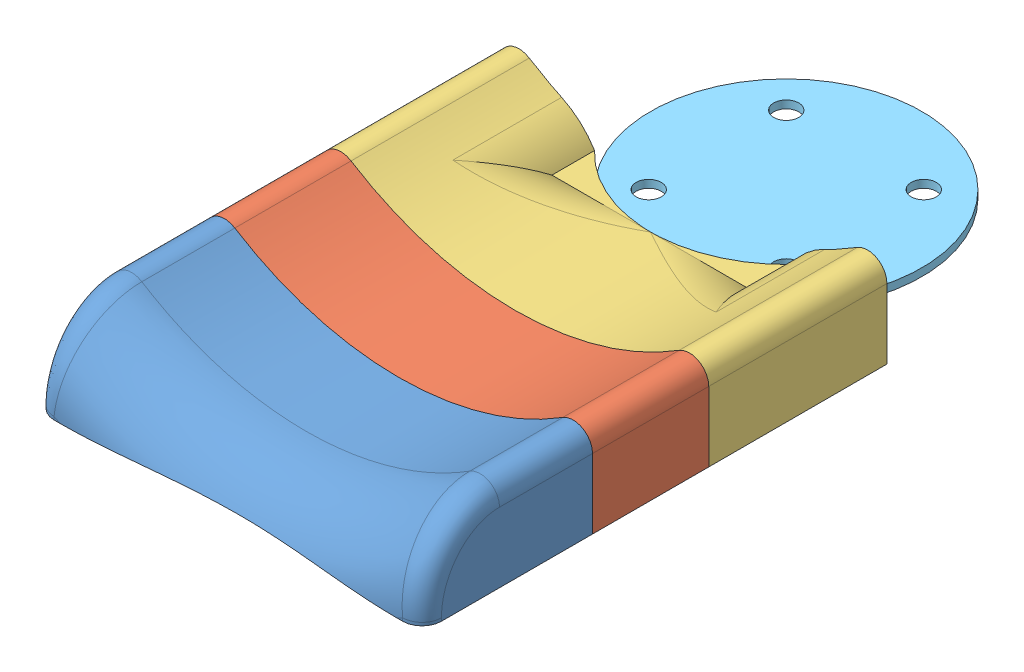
SolidWorks assembly Assem3.sldasm, configuration Default (file format 8000). Lengths in mm.
Overall size (100 24.59 182.67).
6 component instances, 5 part files, 13 mates.
Components (placement in the parent):
- arm brace pt 1-1: arm brace pt 1.SLDPRT [Default] at (40.9448 85.6835 52.0915) size (100 24.59 47.67)
- arm brace pt 2-1: arm brace pt 2.SLDPRT [Default] at (40.9448 85.6835 52.0915) size (100 23.01 35.5)
- arm brace pt 3-1: arm brace pt 3.SLDPRT [Default] at (40.9448 85.6835 52.0915) size (100 23.01 46)
- connector-1: connector.SLDPRT [Default] at (78.9448 94.6835 127.5915) x (1 0 0) z (0 1 0) size (7.5 11.5 7.5)
- connector-2: connector.SLDPRT [Default] at (2.9448 94.6835 127.5915) x (1 0 0) z (0 1 0) size (7.5 11.5 7.5)
- arm brace pt4-1: arm brace pt4.SLDPRT [Default] at (40.9448 85.6835 52.0915) size (70 5 78.97)
Mates (geometry in assembly coordinates):
- Concentric1: concentric anti-aligned: circle of arm brace pt 3-1; circle of connector-2
- Coincident1: coincident anti-aligned: plane of arm brace pt 3-1 through (2.9448 94.6835 116.0915) normal (0 0 1); plane of connector-2 through (2.9448 94.6835 116.0915) normal (0 0 -1)
- Concentric2: concentric anti-aligned: circle of arm brace pt 3-1; circle of connector-1
- Coincident2: coincident anti-aligned: plane of arm brace pt 3-1 through (78.9448 94.6835 116.0915) normal (0 0 1); plane of connector-1 through (78.9448 94.6835 116.0915) normal (0 0 -1)
- Concentric3: concentric aligned: circle of arm brace pt 2-1; circle of connector-1
- Concentric4: concentric aligned: circle of arm brace pt 2-1; circle of connector-2
- Coincident3: coincident anti-aligned: plane of arm brace pt 2-1 through (40.9448 85.6835 122.0915) normal (0 0 -1); plane of arm brace pt 3-1 through (40.9448 85.6835 122.0915) normal (0 0 1)
- Concentric5: concentric anti-aligned: circle of arm brace pt 1-1; circle of arm brace pt 2-1
- Concentric6: concentric anti-aligned: circle of arm brace pt 1-1; circle of arm brace pt 2-1
- Coincident4: coincident anti-aligned: plane of arm brace pt 1-1 through (40.9448 85.6835 152.0915) normal (0 0 -1); plane of arm brace pt 2-1 through (40.9448 85.6835 152.0915) normal (0 0 1)
- Coincident5: coincident aligned: plane of arm brace pt 3-1 through (40.9448 85.6835 52.0915) normal (0 -1 0); plane of arm brace pt4-1 through (40.9448 85.6835 52.0915) normal (0 -1 0)
- Parallel1: parallel aligned: line of arm brace pt 3-1 through (56.1948 85.6835 96.0915) axis (-1 0 0); line of arm brace pt4-1 through (55.1948 85.6835 96.0593) axis (-1 0 0)
- Concentric7: concentric aligned: circle of arm brace pt 3-1; circle of arm brace pt4-1
